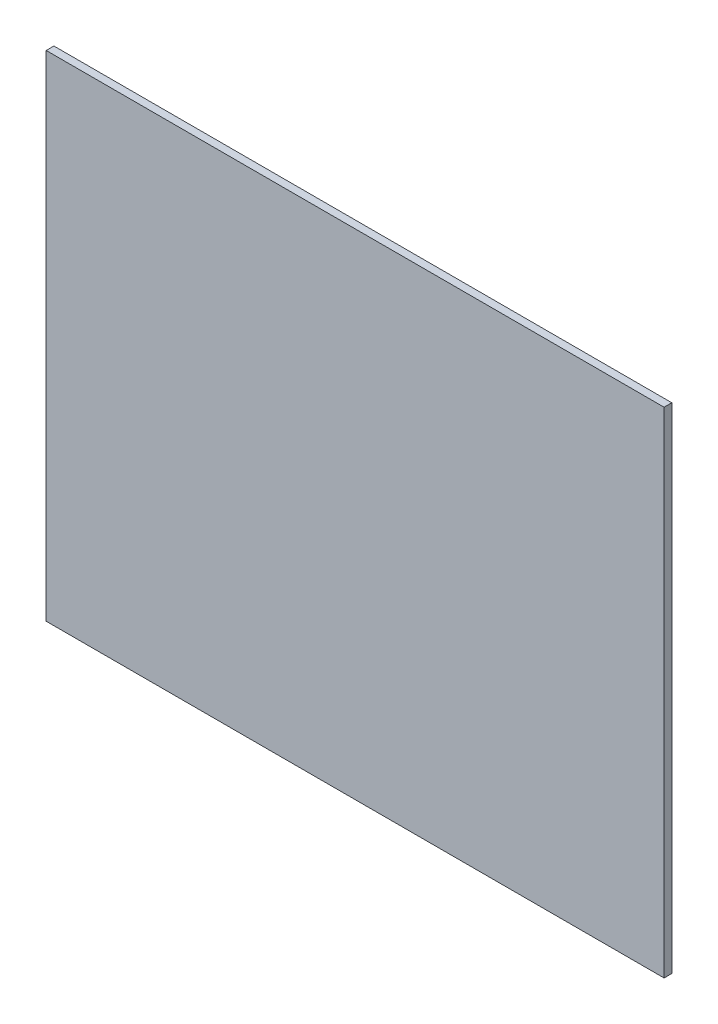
from build123d import *

# Parameters (mm, degrees)
SKETCH1_W           = 253.998984
SKETCH1_H           = 203.2
BOSS_EXTRUDE1_DEPTH = 3.175


with BuildPart() as part:
    # Sketch1 → Boss-Extrude1 (new body)
    with BuildSketch(Plane.XY):
        with Locations((61.103675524, 490.140474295)):
            Rectangle(SKETCH1_W, SKETCH1_H)
    extrude(amount=BOSS_EXTRUDE1_DEPTH)


solid = part.part
